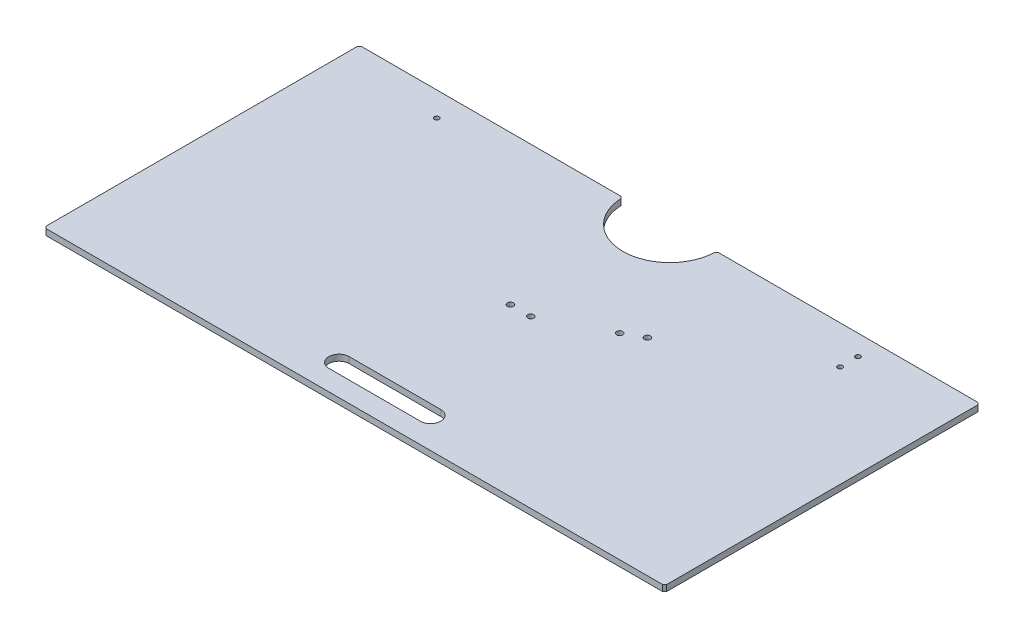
ISO-10303-21;
HEADER;
FILE_DESCRIPTION(('STEP AP214'),'2;1');
FILE_NAME('part.step','',(''),(''),'','','');
FILE_SCHEMA(('AUTOMOTIVE_DESIGN { 1 0 10303 214 1 1 1 1 }'));
ENDSEC;
DATA;
#1=APPLICATION_CONTEXT('core data for automotive mechanical design processes');
#2=APPLICATION_PROTOCOL_DEFINITION('international standard','automotive_design',2000,#1);
#3=PRODUCT_CONTEXT('',#1,'mechanical');
#4=PRODUCT('Part','Part','',(#3));
#5=PRODUCT_RELATED_PRODUCT_CATEGORY('part','',(#4));
#6=PRODUCT_DEFINITION_FORMATION('','',#4);
#7=PRODUCT_DEFINITION_CONTEXT('part definition',#1,'design');
#8=PRODUCT_DEFINITION('design','',#6,#7);
#9=PRODUCT_DEFINITION_SHAPE('','',#8);
#10=(LENGTH_UNIT() NAMED_UNIT(*) SI_UNIT(.MILLI.,.METRE.));
#11=(NAMED_UNIT(*) PLANE_ANGLE_UNIT() SI_UNIT($,.RADIAN.));
#12=(NAMED_UNIT(*) SI_UNIT($,.STERADIAN.) SOLID_ANGLE_UNIT());
#13=UNCERTAINTY_MEASURE_WITH_UNIT(LENGTH_MEASURE(1.E-05),#10,'distance_accuracy_value','');
#14=(GEOMETRIC_REPRESENTATION_CONTEXT(3) GLOBAL_UNCERTAINTY_ASSIGNED_CONTEXT((#13)) GLOBAL_UNIT_ASSIGNED_CONTEXT((#10,
#11,#12)) REPRESENTATION_CONTEXT('',''));
#15=CARTESIAN_POINT('',(0.,0.,0.));
#16=DIRECTION('',(0.,0.,1.));
#17=DIRECTION('',(1.,0.,0.));
#18=AXIS2_PLACEMENT_3D('',#15,#16,#17);
#19=CARTESIAN_POINT('',(305.,6.,-310.));
#20=DIRECTION('',(0.,1.,0.));
#21=DIRECTION('',(0.,0.,1.));
#22=AXIS2_PLACEMENT_3D('',#19,#20,#21);
#23=PLANE('',#22);
#24=CARTESIAN_POINT('',(373.006474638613,6.,-192.83));
#25=DIRECTION('',(0.,1.,0.));
#26=DIRECTION('',(0.,0.,-1.));
#27=AXIS2_PLACEMENT_3D('',#24,#25,#26);
#28=CIRCLE('',#27,3.00000000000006);
#29=CARTESIAN_POINT('',(373.006474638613,6.,-195.83));
#30=VERTEX_POINT('',#29);
#31=EDGE_CURVE('E581',#30,#30,#28,.T.);
#32=ORIENTED_EDGE('',*,*,#31,.F.);
#33=EDGE_LOOP('',(#32));
#34=FACE_BOUND('',#33,.T.);
#35=CARTESIAN_POINT('',(390.418378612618,6.,-202.67));
#36=DIRECTION('',(0.,1.,0.));
#37=DIRECTION('',(0.,0.,-1.));
#38=AXIS2_PLACEMENT_3D('',#35,#36,#37);
#39=CIRCLE('',#38,3.00000000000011);
#40=CARTESIAN_POINT('',(390.418378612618,6.,-205.67));
#41=VERTEX_POINT('',#40);
#42=EDGE_CURVE('E583',#41,#41,#39,.T.);
#43=ORIENTED_EDGE('',*,*,#42,.F.);
#44=EDGE_LOOP('',(#43));
#45=FACE_BOUND('',#44,.T.);
#46=CARTESIAN_POINT('',(315.,6.,-163.5));
#47=DIRECTION('',(0.,1.,0.));
#48=DIRECTION('',(0.,0.,1.));
#49=AXIS2_PLACEMENT_3D('',#46,#47,#48);
#50=CIRCLE('',#49,2.99999999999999);
#51=CARTESIAN_POINT('',(315.,6.,-160.5));
#52=VERTEX_POINT('',#51);
#53=EDGE_CURVE('E589',#52,#52,#50,.T.);
#54=ORIENTED_EDGE('',*,*,#53,.F.);
#55=EDGE_LOOP('',(#54));
#56=FACE_BOUND('',#55,.T.);
#57=CARTESIAN_POINT('',(295.,6.,-163.5));
#58=DIRECTION('',(0.,1.,0.));
#59=DIRECTION('',(0.,0.,1.));
#60=AXIS2_PLACEMENT_3D('',#57,#58,#59);
#61=CIRCLE('',#60,2.99999999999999);
#62=CARTESIAN_POINT('',(295.,6.,-160.5));
#63=VERTEX_POINT('',#62);
#64=EDGE_CURVE('E595',#63,#63,#61,.T.);
#65=ORIENTED_EDGE('',*,*,#64,.F.);
#66=EDGE_LOOP('',(#65));
#67=FACE_BOUND('',#66,.T.);
#68=CARTESIAN_POINT('',(510.,6.,-272.5));
#69=DIRECTION('',(0.,1.,0.));
#70=DIRECTION('',(0.,0.,1.));
#71=AXIS2_PLACEMENT_3D('',#68,#69,#70);
#72=CIRCLE('',#71,2.39999999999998);
#73=CARTESIAN_POINT('',(510.,6.,-270.1));
#74=VERTEX_POINT('',#73);
#75=EDGE_CURVE('E191',#74,#74,#72,.T.);
#76=ORIENTED_EDGE('',*,*,#75,.F.);
#77=EDGE_LOOP('',(#76));
#78=FACE_BOUND('',#77,.T.);
#79=CARTESIAN_POINT('',(100.,6.,-286.));
#80=DIRECTION('',(0.,1.,0.));
#81=DIRECTION('',(0.,0.,1.));
#82=AXIS2_PLACEMENT_3D('',#79,#80,#81);
#83=CIRCLE('',#82,2.4);
#84=CARTESIAN_POINT('',(100.,6.,-283.6));
#85=VERTEX_POINT('',#84);
#86=EDGE_CURVE('E203',#85,#85,#83,.T.);
#87=ORIENTED_EDGE('',*,*,#86,.F.);
#88=EDGE_LOOP('',(#87));
#89=FACE_BOUND('',#88,.T.);
#90=DIRECTION('',(1.,0.,0.));
#91=VECTOR('',#90,1.);
#92=CARTESIAN_POINT('',(0.,6.,0.));
#93=LINE('',#92,#91);
#94=CARTESIAN_POINT('',(1.99999999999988,6.,0.));
#95=VERTEX_POINT('',#94);
#96=CARTESIAN_POINT('',(608.,6.,0.));
#97=VERTEX_POINT('',#96);
#98=EDGE_CURVE('E212',#95,#97,#93,.T.);
#99=ORIENTED_EDGE('',*,*,#98,.T.);
#100=DIRECTION('',(-0.707106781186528,0.,0.707106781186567));
#101=VECTOR('',#100,1.);
#102=CARTESIAN_POINT('',(611.500000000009,6.,-3.50000000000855));
#103=LINE('',#102,#101);
#104=CARTESIAN_POINT('',(610.,6.,-1.99999999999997));
#105=VERTEX_POINT('',#104);
#106=EDGE_CURVE('E272',#97,#105,#103,.F.);
#107=ORIENTED_EDGE('',*,*,#106,.T.);
#108=DIRECTION('',(0.,0.,-1.));
#109=VECTOR('',#108,1.);
#110=CARTESIAN_POINT('',(610.,6.,0.));
#111=LINE('',#110,#109);
#112=CARTESIAN_POINT('',(610.,6.,-308.));
#113=VERTEX_POINT('',#112);
#114=EDGE_CURVE('E216',#105,#113,#111,.T.);
#115=ORIENTED_EDGE('',*,*,#114,.T.);
#116=DIRECTION('',(0.707106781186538,0.,0.707106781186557));
#117=VECTOR('',#116,1.);
#118=CARTESIAN_POINT('',(456.500000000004,6.,-461.5));
#119=LINE('',#118,#117);
#120=CARTESIAN_POINT('',(608.,6.,-310.));
#121=VERTEX_POINT('',#120);
#122=EDGE_CURVE('E266',#113,#121,#119,.F.);
#123=ORIENTED_EDGE('',*,*,#122,.T.);
#124=DIRECTION('',(-1.,0.,0.));
#125=VECTOR('',#124,1.);
#126=CARTESIAN_POINT('',(351.,6.,-310.));
#127=LINE('',#126,#125);
#128=CARTESIAN_POINT('',(353.,6.,-310.));
#129=VERTEX_POINT('',#128);
#130=EDGE_CURVE('E219',#121,#129,#127,.T.);
#131=ORIENTED_EDGE('',*,*,#130,.T.);
#132=DIRECTION('',(0.707106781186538,0.,-0.707106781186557));
#133=VECTOR('',#132,1.);
#134=CARTESIAN_POINT('',(329.000000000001,6.,-286.));
#135=LINE('',#134,#133);
#136=CARTESIAN_POINT('',(350.9544984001,6.,-307.9544984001));
#137=VERTEX_POINT('',#136);
#138=EDGE_CURVE('E264',#129,#137,#135,.F.);
#139=ORIENTED_EDGE('',*,*,#138,.T.);
#140=CARTESIAN_POINT('',(305.,6.,-310.));
#141=DIRECTION('',(0.,-1.,0.));
#142=DIRECTION('',(0.,0.,1.));
#143=AXIS2_PLACEMENT_3D('',#140,#141,#142);
#144=CIRCLE('',#143,46.);
#145=CARTESIAN_POINT('',(259.0455015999,6.,-307.9544984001));
#146=VERTEX_POINT('',#145);
#147=EDGE_CURVE('E222',#137,#146,#144,.T.);
#148=ORIENTED_EDGE('',*,*,#147,.T.);
#149=DIRECTION('',(0.707106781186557,0.,0.707106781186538));
#150=VECTOR('',#149,1.);
#151=CARTESIAN_POINT('',(281.000000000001,6.,-286.));
#152=LINE('',#151,#150);
#153=CARTESIAN_POINT('',(257.,6.,-310.));
#154=VERTEX_POINT('',#153);
#155=EDGE_CURVE('E54',#146,#154,#152,.F.);
#156=ORIENTED_EDGE('',*,*,#155,.T.);
#157=DIRECTION('',(-1.,0.,0.));
#158=VECTOR('',#157,1.);
#159=CARTESIAN_POINT('',(0.,6.,-310.));
#160=LINE('',#159,#158);
#161=CARTESIAN_POINT('',(2.,6.,-310.));
#162=VERTEX_POINT('',#161);
#163=EDGE_CURVE('E224',#154,#162,#160,.T.);
#164=ORIENTED_EDGE('',*,*,#163,.T.);
#165=DIRECTION('',(0.707106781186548,0.,-0.707106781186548));
#166=VECTOR('',#165,1.);
#167=CARTESIAN_POINT('',(153.5,6.,-461.5));
#168=LINE('',#167,#166);
#169=CARTESIAN_POINT('',(0.,6.,-308.));
#170=VERTEX_POINT('',#169);
#171=EDGE_CURVE('E268',#162,#170,#168,.F.);
#172=ORIENTED_EDGE('',*,*,#171,.T.);
#173=DIRECTION('',(0.,0.,1.));
#174=VECTOR('',#173,1.);
#175=CARTESIAN_POINT('',(0.,6.,0.));
#176=LINE('',#175,#174);
#177=CARTESIAN_POINT('',(0.,6.,-1.99999999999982));
#178=VERTEX_POINT('',#177);
#179=EDGE_CURVE('E209',#170,#178,#176,.T.);
#180=ORIENTED_EDGE('',*,*,#179,.T.);
#181=DIRECTION('',(-0.707106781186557,0.,-0.707106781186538));
#182=VECTOR('',#181,1.);
#183=CARTESIAN_POINT('',(-1.49999999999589,6.,-3.49999999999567));
#184=LINE('',#183,#182);
#185=EDGE_CURVE('E270',#178,#95,#184,.F.);
#186=ORIENTED_EDGE('',*,*,#185,.T.);
#187=EDGE_LOOP('',(#99,#107,#115,#123,#131,#139,#148,#156,#164,#172,#180,#186));
#188=FACE_BOUND('',#187,.T.);
#189=CARTESIAN_POINT('',(510.,6.,-290.));
#190=DIRECTION('',(0.,1.,0.));
#191=DIRECTION('',(0.,0.,1.));
#192=AXIS2_PLACEMENT_3D('',#189,#190,#191);
#193=CIRCLE('',#192,2.39999999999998);
#194=CARTESIAN_POINT('',(510.,6.,-287.6));
#195=VERTEX_POINT('',#194);
#196=EDGE_CURVE('E197',#195,#195,#193,.T.);
#197=ORIENTED_EDGE('',*,*,#196,.F.);
#198=EDGE_LOOP('',(#197));
#199=FACE_BOUND('',#198,.T.);
#200=DIRECTION('',(1.,0.,0.));
#201=VECTOR('',#200,1.);
#202=CARTESIAN_POINT('',(260.,6.,-20.));
#203=LINE('',#202,#201);
#204=CARTESIAN_POINT('',(260.,6.,-20.));
#205=VERTEX_POINT('',#204);
#206=CARTESIAN_POINT('',(350.,6.,-20.));
#207=VERTEX_POINT('',#206);
#208=EDGE_CURVE('E158',#205,#207,#203,.T.);
#209=ORIENTED_EDGE('',*,*,#208,.F.);
#210=CARTESIAN_POINT('',(260.,6.,-30.));
#211=DIRECTION('',(0.,1.,0.));
#212=DIRECTION('',(0.,0.,1.));
#213=AXIS2_PLACEMENT_3D('',#210,#211,#212);
#214=CIRCLE('',#213,10.);
#215=CARTESIAN_POINT('',(260.,6.,-40.));
#216=VERTEX_POINT('',#215);
#217=EDGE_CURVE('E148',#216,#205,#214,.T.);
#218=ORIENTED_EDGE('',*,*,#217,.F.);
#219=DIRECTION('',(-1.,0.,0.));
#220=VECTOR('',#219,1.);
#221=CARTESIAN_POINT('',(260.,6.,-40.));
#222=LINE('',#221,#220);
#223=CARTESIAN_POINT('',(350.,6.,-40.));
#224=VERTEX_POINT('',#223);
#225=EDGE_CURVE('E173',#224,#216,#222,.T.);
#226=ORIENTED_EDGE('',*,*,#225,.F.);
#227=CARTESIAN_POINT('',(350.,6.,-30.));
#228=DIRECTION('',(0.,1.,0.));
#229=DIRECTION('',(0.,0.,1.));
#230=AXIS2_PLACEMENT_3D('',#227,#228,#229);
#231=CIRCLE('',#230,10.);
#232=EDGE_CURVE('E171',#207,#224,#231,.T.);
#233=ORIENTED_EDGE('',*,*,#232,.F.);
#234=EDGE_LOOP('',(#209,#218,#226,#233));
#235=FACE_BOUND('',#234,.T.);
#236=ADVANCED_FACE('F32',(#34,#45,#56,#67,#78,#89,#188,#199,#235),#23,.T.);
#237=CARTESIAN_POINT('',(305.,0.,-310.));
#238=DIRECTION('',(0.,1.,0.));
#239=DIRECTION('',(0.,0.,1.));
#240=AXIS2_PLACEMENT_3D('',#237,#238,#239);
#241=PLANE('',#240);
#242=CARTESIAN_POINT('',(373.006474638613,0.,-192.83));
#243=DIRECTION('',(0.,1.,0.));
#244=DIRECTION('',(0.,0.,-1.));
#245=AXIS2_PLACEMENT_3D('',#242,#243,#244);
#246=CIRCLE('',#245,3.00000000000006);
#247=CARTESIAN_POINT('',(373.006474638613,0.,-195.83));
#248=VERTEX_POINT('',#247);
#249=EDGE_CURVE('E579',#248,#248,#246,.T.);
#250=ORIENTED_EDGE('',*,*,#249,.T.);
#251=EDGE_LOOP('',(#250));
#252=FACE_BOUND('',#251,.T.);
#253=CARTESIAN_POINT('',(390.418378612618,0.,-202.67));
#254=DIRECTION('',(0.,1.,0.));
#255=DIRECTION('',(0.,0.,-1.));
#256=AXIS2_PLACEMENT_3D('',#253,#254,#255);
#257=CIRCLE('',#256,3.00000000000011);
#258=CARTESIAN_POINT('',(390.418378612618,0.,-205.67));
#259=VERTEX_POINT('',#258);
#260=EDGE_CURVE('E586',#259,#259,#257,.T.);
#261=ORIENTED_EDGE('',*,*,#260,.T.);
#262=EDGE_LOOP('',(#261));
#263=FACE_BOUND('',#262,.T.);
#264=CARTESIAN_POINT('',(315.,0.,-163.5));
#265=DIRECTION('',(0.,1.,0.));
#266=DIRECTION('',(0.,0.,1.));
#267=AXIS2_PLACEMENT_3D('',#264,#265,#266);
#268=CIRCLE('',#267,2.99999999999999);
#269=CARTESIAN_POINT('',(315.,0.,-160.5));
#270=VERTEX_POINT('',#269);
#271=EDGE_CURVE('E592',#270,#270,#268,.T.);
#272=ORIENTED_EDGE('',*,*,#271,.T.);
#273=EDGE_LOOP('',(#272));
#274=FACE_BOUND('',#273,.T.);
#275=CARTESIAN_POINT('',(295.,0.,-163.5));
#276=DIRECTION('',(0.,1.,0.));
#277=DIRECTION('',(0.,0.,1.));
#278=AXIS2_PLACEMENT_3D('',#275,#276,#277);
#279=CIRCLE('',#278,2.99999999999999);
#280=CARTESIAN_POINT('',(295.,0.,-160.5));
#281=VERTEX_POINT('',#280);
#282=EDGE_CURVE('E180',#281,#281,#279,.T.);
#283=ORIENTED_EDGE('',*,*,#282,.T.);
#284=EDGE_LOOP('',(#283));
#285=FACE_BOUND('',#284,.T.);
#286=CARTESIAN_POINT('',(510.,0.,-272.5));
#287=DIRECTION('',(0.,1.,0.));
#288=DIRECTION('',(0.,0.,1.));
#289=AXIS2_PLACEMENT_3D('',#286,#287,#288);
#290=CIRCLE('',#289,2.39999999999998);
#291=CARTESIAN_POINT('',(510.,0.,-270.1));
#292=VERTEX_POINT('',#291);
#293=EDGE_CURVE('E166',#292,#292,#290,.T.);
#294=ORIENTED_EDGE('',*,*,#293,.T.);
#295=EDGE_LOOP('',(#294));
#296=FACE_BOUND('',#295,.T.);
#297=CARTESIAN_POINT('',(100.,0.,-286.));
#298=DIRECTION('',(0.,1.,0.));
#299=DIRECTION('',(0.,0.,1.));
#300=AXIS2_PLACEMENT_3D('',#297,#298,#299);
#301=CIRCLE('',#300,2.4);
#302=CARTESIAN_POINT('',(100.,0.,-283.6));
#303=VERTEX_POINT('',#302);
#304=EDGE_CURVE('E200',#303,#303,#301,.T.);
#305=ORIENTED_EDGE('',*,*,#304,.T.);
#306=EDGE_LOOP('',(#305));
#307=FACE_BOUND('',#306,.T.);
#308=DIRECTION('',(0.,0.,-1.));
#309=VECTOR('',#308,1.);
#310=CARTESIAN_POINT('',(610.,0.,0.));
#311=LINE('',#310,#309);
#312=CARTESIAN_POINT('',(610.,0.,-2.));
#313=VERTEX_POINT('',#312);
#314=CARTESIAN_POINT('',(610.,0.,-308.));
#315=VERTEX_POINT('',#314);
#316=EDGE_CURVE('E232',#313,#315,#311,.T.);
#317=ORIENTED_EDGE('',*,*,#316,.F.);
#318=DIRECTION('',(0.707106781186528,0.,-0.707106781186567));
#319=VECTOR('',#318,1.);
#320=CARTESIAN_POINT('',(610.,0.,-2.));
#321=LINE('',#320,#319);
#322=CARTESIAN_POINT('',(608.,0.,0.));
#323=VERTEX_POINT('',#322);
#324=EDGE_CURVE('E256',#313,#323,#321,.F.);
#325=ORIENTED_EDGE('',*,*,#324,.T.);
#326=DIRECTION('',(1.,0.,0.));
#327=VECTOR('',#326,1.);
#328=CARTESIAN_POINT('',(0.,0.,0.));
#329=LINE('',#328,#327);
#330=CARTESIAN_POINT('',(2.,0.,0.));
#331=VERTEX_POINT('',#330);
#332=EDGE_CURVE('E229',#331,#323,#329,.T.);
#333=ORIENTED_EDGE('',*,*,#332,.F.);
#334=DIRECTION('',(0.707106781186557,0.,0.707106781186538));
#335=VECTOR('',#334,1.);
#336=CARTESIAN_POINT('',(2.,0.,0.));
#337=LINE('',#336,#335);
#338=CARTESIAN_POINT('',(0.,0.,-1.99999999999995));
#339=VERTEX_POINT('',#338);
#340=EDGE_CURVE('E254',#331,#339,#337,.F.);
#341=ORIENTED_EDGE('',*,*,#340,.T.);
#342=DIRECTION('',(0.,0.,1.));
#343=VECTOR('',#342,1.);
#344=CARTESIAN_POINT('',(0.,0.,0.));
#345=LINE('',#344,#343);
#346=CARTESIAN_POINT('',(0.,0.,-308.));
#347=VERTEX_POINT('',#346);
#348=EDGE_CURVE('E206',#347,#339,#345,.T.);
#349=ORIENTED_EDGE('',*,*,#348,.F.);
#350=DIRECTION('',(-0.707106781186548,0.,0.707106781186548));
#351=VECTOR('',#350,1.);
#352=CARTESIAN_POINT('',(0.,0.,-308.));
#353=LINE('',#352,#351);
#354=CARTESIAN_POINT('',(2.,0.,-310.));
#355=VERTEX_POINT('',#354);
#356=EDGE_CURVE('E252',#347,#355,#353,.F.);
#357=ORIENTED_EDGE('',*,*,#356,.T.);
#358=DIRECTION('',(-1.,0.,0.));
#359=VECTOR('',#358,1.);
#360=CARTESIAN_POINT('',(0.,0.,-310.));
#361=LINE('',#360,#359);
#362=CARTESIAN_POINT('',(257.,0.,-310.));
#363=VERTEX_POINT('',#362);
#364=EDGE_CURVE('E213',#363,#355,#361,.T.);
#365=ORIENTED_EDGE('',*,*,#364,.F.);
#366=DIRECTION('',(-0.707106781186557,0.,-0.707106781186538));
#367=VECTOR('',#366,1.);
#368=CARTESIAN_POINT('',(257.,0.,-310.));
#369=LINE('',#368,#367);
#370=CARTESIAN_POINT('',(259.0455015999,0.,-307.9544984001));
#371=VERTEX_POINT('',#370);
#372=EDGE_CURVE('E246',#363,#371,#369,.F.);
#373=ORIENTED_EDGE('',*,*,#372,.T.);
#374=CARTESIAN_POINT('',(305.,0.,-310.));
#375=DIRECTION('',(0.,-1.,0.));
#376=DIRECTION('',(0.,0.,1.));
#377=AXIS2_PLACEMENT_3D('',#374,#375,#376);
#378=CIRCLE('',#377,46.);
#379=CARTESIAN_POINT('',(350.9544984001,0.,-307.9544984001));
#380=VERTEX_POINT('',#379);
#381=EDGE_CURVE('E238',#380,#371,#378,.T.);
#382=ORIENTED_EDGE('',*,*,#381,.F.);
#383=DIRECTION('',(-0.707106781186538,0.,0.707106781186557));
#384=VECTOR('',#383,1.);
#385=CARTESIAN_POINT('',(350.9544984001,0.,-307.9544984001));
#386=LINE('',#385,#384);
#387=CARTESIAN_POINT('',(353.,0.,-310.));
#388=VERTEX_POINT('',#387);
#389=EDGE_CURVE('E248',#380,#388,#386,.F.);
#390=ORIENTED_EDGE('',*,*,#389,.T.);
#391=DIRECTION('',(-1.,0.,0.));
#392=VECTOR('',#391,1.);
#393=CARTESIAN_POINT('',(351.,0.,-310.));
#394=LINE('',#393,#392);
#395=CARTESIAN_POINT('',(608.,0.,-310.));
#396=VERTEX_POINT('',#395);
#397=EDGE_CURVE('E235',#396,#388,#394,.T.);
#398=ORIENTED_EDGE('',*,*,#397,.F.);
#399=DIRECTION('',(-0.707106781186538,0.,-0.707106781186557));
#400=VECTOR('',#399,1.);
#401=CARTESIAN_POINT('',(608.,0.,-310.));
#402=LINE('',#401,#400);
#403=EDGE_CURVE('E250',#396,#315,#402,.F.);
#404=ORIENTED_EDGE('',*,*,#403,.T.);
#405=EDGE_LOOP('',(#317,#325,#333,#341,#349,#357,#365,#373,#382,#390,#398,#404));
#406=FACE_BOUND('',#405,.T.);
#407=CARTESIAN_POINT('',(510.,0.,-290.));
#408=DIRECTION('',(0.,1.,0.));
#409=DIRECTION('',(0.,0.,1.));
#410=AXIS2_PLACEMENT_3D('',#407,#408,#409);
#411=CIRCLE('',#410,2.39999999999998);
#412=CARTESIAN_POINT('',(510.,0.,-287.6));
#413=VERTEX_POINT('',#412);
#414=EDGE_CURVE('E194',#413,#413,#411,.T.);
#415=ORIENTED_EDGE('',*,*,#414,.T.);
#416=EDGE_LOOP('',(#415));
#417=FACE_BOUND('',#416,.T.);
#418=CARTESIAN_POINT('',(260.,0.,-30.));
#419=DIRECTION('',(0.,1.,0.));
#420=DIRECTION('',(0.,0.,1.));
#421=AXIS2_PLACEMENT_3D('',#418,#419,#420);
#422=CIRCLE('',#421,10.);
#423=CARTESIAN_POINT('',(260.,0.,-40.));
#424=VERTEX_POINT('',#423);
#425=CARTESIAN_POINT('',(260.,0.,-20.));
#426=VERTEX_POINT('',#425);
#427=EDGE_CURVE('E178',#424,#426,#422,.T.);
#428=ORIENTED_EDGE('',*,*,#427,.T.);
#429=DIRECTION('',(1.,0.,0.));
#430=VECTOR('',#429,1.);
#431=CARTESIAN_POINT('',(260.,0.,-20.));
#432=LINE('',#431,#430);
#433=CARTESIAN_POINT('',(350.,0.,-20.));
#434=VERTEX_POINT('',#433);
#435=EDGE_CURVE('E165',#426,#434,#432,.T.);
#436=ORIENTED_EDGE('',*,*,#435,.T.);
#437=CARTESIAN_POINT('',(350.,0.,-30.));
#438=DIRECTION('',(0.,1.,0.));
#439=DIRECTION('',(0.,0.,1.));
#440=AXIS2_PLACEMENT_3D('',#437,#438,#439);
#441=CIRCLE('',#440,10.);
#442=CARTESIAN_POINT('',(350.,0.,-40.));
#443=VERTEX_POINT('',#442);
#444=EDGE_CURVE('E182',#434,#443,#441,.T.);
#445=ORIENTED_EDGE('',*,*,#444,.T.);
#446=DIRECTION('',(-1.,0.,0.));
#447=VECTOR('',#446,1.);
#448=CARTESIAN_POINT('',(260.,0.,-40.));
#449=LINE('',#448,#447);
#450=EDGE_CURVE('E159',#443,#424,#449,.T.);
#451=ORIENTED_EDGE('',*,*,#450,.T.);
#452=EDGE_LOOP('',(#428,#436,#445,#451));
#453=FACE_BOUND('',#452,.T.);
#454=ADVANCED_FACE('F301',(#252,#263,#274,#285,#296,#307,#406,#417,#453),#241,.F.);
#455=CARTESIAN_POINT('',(0.,6.,0.));
#456=DIRECTION('',(1.,0.,0.));
#457=DIRECTION('',(0.,0.,-1.));
#458=AXIS2_PLACEMENT_3D('',#455,#456,#457);
#459=PLANE('',#458);
#460=ORIENTED_EDGE('',*,*,#348,.T.);
#461=DIRECTION('',(0.,1.,0.));
#462=VECTOR('',#461,1.);
#463=CARTESIAN_POINT('',(0.,6.,-1.99999999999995));
#464=LINE('',#463,#462);
#465=EDGE_CURVE('E277',#339,#178,#464,.T.);
#466=ORIENTED_EDGE('',*,*,#465,.T.);
#467=ORIENTED_EDGE('',*,*,#179,.F.);
#468=DIRECTION('',(0.,-1.,0.));
#469=VECTOR('',#468,1.);
#470=CARTESIAN_POINT('',(0.,6.,-308.));
#471=LINE('',#470,#469);
#472=EDGE_CURVE('E274',#170,#347,#471,.T.);
#473=ORIENTED_EDGE('',*,*,#472,.T.);
#474=EDGE_LOOP('',(#460,#466,#467,#473));
#475=FACE_BOUND('',#474,.T.);
#476=ADVANCED_FACE('F310',(#475),#459,.F.);
#477=CARTESIAN_POINT('',(0.,6.,0.));
#478=DIRECTION('',(0.,0.,-1.));
#479=DIRECTION('',(-1.,0.,0.));
#480=AXIS2_PLACEMENT_3D('',#477,#478,#479);
#481=PLANE('',#480);
#482=ORIENTED_EDGE('',*,*,#332,.T.);
#483=DIRECTION('',(0.,1.,0.));
#484=VECTOR('',#483,1.);
#485=CARTESIAN_POINT('',(608.,6.,0.));
#486=LINE('',#485,#484);
#487=EDGE_CURVE('E261',#323,#97,#486,.T.);
#488=ORIENTED_EDGE('',*,*,#487,.T.);
#489=ORIENTED_EDGE('',*,*,#98,.F.);
#490=DIRECTION('',(0.,-1.,0.));
#491=VECTOR('',#490,1.);
#492=CARTESIAN_POINT('',(2.,6.,0.));
#493=LINE('',#492,#491);
#494=EDGE_CURVE('E258',#95,#331,#493,.T.);
#495=ORIENTED_EDGE('',*,*,#494,.T.);
#496=EDGE_LOOP('',(#482,#488,#489,#495));
#497=FACE_BOUND('',#496,.T.);
#498=ADVANCED_FACE('F319',(#497),#481,.F.);
#499=CARTESIAN_POINT('',(610.,6.,0.));
#500=DIRECTION('',(-1.,0.,0.));
#501=DIRECTION('',(0.,0.,1.));
#502=AXIS2_PLACEMENT_3D('',#499,#500,#501);
#503=PLANE('',#502);
#504=ORIENTED_EDGE('',*,*,#114,.F.);
#505=DIRECTION('',(0.,-1.,0.));
#506=VECTOR('',#505,1.);
#507=CARTESIAN_POINT('',(610.,6.,-2.));
#508=LINE('',#507,#506);
#509=EDGE_CURVE('E243',#105,#313,#508,.T.);
#510=ORIENTED_EDGE('',*,*,#509,.T.);
#511=ORIENTED_EDGE('',*,*,#316,.T.);
#512=DIRECTION('',(0.,1.,0.));
#513=VECTOR('',#512,1.);
#514=CARTESIAN_POINT('',(610.,6.,-308.));
#515=LINE('',#514,#513);
#516=EDGE_CURVE('E226',#315,#113,#515,.T.);
#517=ORIENTED_EDGE('',*,*,#516,.T.);
#518=EDGE_LOOP('',(#504,#510,#511,#517));
#519=FACE_BOUND('',#518,.T.);
#520=ADVANCED_FACE('F327',(#519),#503,.F.);
#521=CARTESIAN_POINT('',(351.,6.,-310.));
#522=DIRECTION('',(0.,0.,1.));
#523=DIRECTION('',(1.,0.,0.));
#524=AXIS2_PLACEMENT_3D('',#521,#522,#523);
#525=PLANE('',#524);
#526=ORIENTED_EDGE('',*,*,#130,.F.);
#527=DIRECTION('',(0.,-1.,0.));
#528=VECTOR('',#527,1.);
#529=CARTESIAN_POINT('',(608.,6.,-310.));
#530=LINE('',#529,#528);
#531=EDGE_CURVE('E285',#121,#396,#530,.T.);
#532=ORIENTED_EDGE('',*,*,#531,.T.);
#533=ORIENTED_EDGE('',*,*,#397,.T.);
#534=DIRECTION('',(0.,1.,0.));
#535=VECTOR('',#534,1.);
#536=CARTESIAN_POINT('',(353.,6.,-310.));
#537=LINE('',#536,#535);
#538=EDGE_CURVE('E283',#388,#129,#537,.T.);
#539=ORIENTED_EDGE('',*,*,#538,.T.);
#540=EDGE_LOOP('',(#526,#532,#533,#539));
#541=FACE_BOUND('',#540,.T.);
#542=ADVANCED_FACE('F336',(#541),#525,.F.);
#543=CARTESIAN_POINT('',(305.,6.,-310.));
#544=DIRECTION('',(0.,-1.,0.));
#545=DIRECTION('',(0.,0.,-1.));
#546=AXIS2_PLACEMENT_3D('',#543,#544,#545);
#547=CYLINDRICAL_SURFACE('',#546,46.);
#548=ORIENTED_EDGE('',*,*,#147,.F.);
#549=DIRECTION('',(0.,-1.,0.));
#550=VECTOR('',#549,1.);
#551=CARTESIAN_POINT('',(350.9544984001,6.,-307.9544984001));
#552=LINE('',#551,#550);
#553=EDGE_CURVE('E11',#137,#380,#552,.T.);
#554=ORIENTED_EDGE('',*,*,#553,.T.);
#555=ORIENTED_EDGE('',*,*,#381,.T.);
#556=DIRECTION('',(0.,-1.,0.));
#557=VECTOR('',#556,1.);
#558=CARTESIAN_POINT('',(259.0455015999,6.,-307.9544984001));
#559=LINE('',#558,#557);
#560=EDGE_CURVE('E40',#371,#146,#559,.F.);
#561=ORIENTED_EDGE('',*,*,#560,.T.);
#562=EDGE_LOOP('',(#548,#554,#555,#561));
#563=FACE_BOUND('',#562,.T.);
#564=ADVANCED_FACE('F290',(#563),#547,.F.);
#565=CARTESIAN_POINT('',(0.,6.,-310.));
#566=DIRECTION('',(0.,0.,1.));
#567=DIRECTION('',(1.,0.,0.));
#568=AXIS2_PLACEMENT_3D('',#565,#566,#567);
#569=PLANE('',#568);
#570=ORIENTED_EDGE('',*,*,#364,.T.);
#571=DIRECTION('',(0.,1.,0.));
#572=VECTOR('',#571,1.);
#573=CARTESIAN_POINT('',(2.,6.,-310.));
#574=LINE('',#573,#572);
#575=EDGE_CURVE('E47',#355,#162,#574,.T.);
#576=ORIENTED_EDGE('',*,*,#575,.T.);
#577=ORIENTED_EDGE('',*,*,#163,.F.);
#578=DIRECTION('',(0.,-1.,0.));
#579=VECTOR('',#578,1.);
#580=CARTESIAN_POINT('',(257.,6.,-310.));
#581=LINE('',#580,#579);
#582=EDGE_CURVE('E279',#154,#363,#581,.T.);
#583=ORIENTED_EDGE('',*,*,#582,.T.);
#584=EDGE_LOOP('',(#570,#576,#577,#583));
#585=FACE_BOUND('',#584,.T.);
#586=ADVANCED_FACE('F298',(#585),#569,.F.);
#587=CARTESIAN_POINT('',(100.,6.,-286.));
#588=DIRECTION('',(0.,-1.,0.));
#589=DIRECTION('',(0.,0.,-1.));
#590=AXIS2_PLACEMENT_3D('',#587,#588,#589);
#591=CYLINDRICAL_SURFACE('',#590,2.4);
#592=ORIENTED_EDGE('',*,*,#86,.T.);
#593=EDGE_LOOP('',(#592));
#594=FACE_BOUND('',#593,.T.);
#595=ORIENTED_EDGE('',*,*,#304,.F.);
#596=EDGE_LOOP('',(#595));
#597=FACE_BOUND('',#596,.T.);
#598=ADVANCED_FACE('F358',(#594,#597),#591,.F.);
#599=CARTESIAN_POINT('',(510.,6.,-290.));
#600=DIRECTION('',(0.,-1.,0.));
#601=DIRECTION('',(0.,0.,-1.));
#602=AXIS2_PLACEMENT_3D('',#599,#600,#601);
#603=CYLINDRICAL_SURFACE('',#602,2.39999999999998);
#604=ORIENTED_EDGE('',*,*,#196,.T.);
#605=EDGE_LOOP('',(#604));
#606=FACE_BOUND('',#605,.T.);
#607=ORIENTED_EDGE('',*,*,#414,.F.);
#608=EDGE_LOOP('',(#607));
#609=FACE_BOUND('',#608,.T.);
#610=ADVANCED_FACE('F467',(#606,#609),#603,.F.);
#611=CARTESIAN_POINT('',(510.,6.,-272.5));
#612=DIRECTION('',(0.,-1.,0.));
#613=DIRECTION('',(0.,0.,-1.));
#614=AXIS2_PLACEMENT_3D('',#611,#612,#613);
#615=CYLINDRICAL_SURFACE('',#614,2.39999999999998);
#616=ORIENTED_EDGE('',*,*,#75,.T.);
#617=EDGE_LOOP('',(#616));
#618=FACE_BOUND('',#617,.T.);
#619=ORIENTED_EDGE('',*,*,#293,.F.);
#620=EDGE_LOOP('',(#619));
#621=FACE_BOUND('',#620,.T.);
#622=ADVANCED_FACE('F465',(#618,#621),#615,.F.);
#623=CARTESIAN_POINT('',(260.,6.,-30.));
#624=DIRECTION('',(0.,-1.,0.));
#625=DIRECTION('',(0.,0.,-1.));
#626=AXIS2_PLACEMENT_3D('',#623,#624,#625);
#627=CYLINDRICAL_SURFACE('',#626,10.);
#628=ORIENTED_EDGE('',*,*,#427,.F.);
#629=DIRECTION('',(0.,-1.,0.));
#630=VECTOR('',#629,1.);
#631=CARTESIAN_POINT('',(260.,6.,-40.));
#632=LINE('',#631,#630);
#633=EDGE_CURVE('E154',#216,#424,#632,.T.);
#634=ORIENTED_EDGE('',*,*,#633,.F.);
#635=ORIENTED_EDGE('',*,*,#217,.T.);
#636=DIRECTION('',(0.,-1.,0.));
#637=VECTOR('',#636,1.);
#638=CARTESIAN_POINT('',(260.,6.,-20.));
#639=LINE('',#638,#637);
#640=EDGE_CURVE('E151',#205,#426,#639,.T.);
#641=ORIENTED_EDGE('',*,*,#640,.T.);
#642=EDGE_LOOP('',(#628,#634,#635,#641));
#643=FACE_BOUND('',#642,.T.);
#644=ADVANCED_FACE('F150',(#643),#627,.F.);
#645=CARTESIAN_POINT('',(260.,6.,-20.));
#646=DIRECTION('',(0.,0.,-1.));
#647=DIRECTION('',(-1.,0.,0.));
#648=AXIS2_PLACEMENT_3D('',#645,#646,#647);
#649=PLANE('',#648);
#650=ORIENTED_EDGE('',*,*,#435,.F.);
#651=ORIENTED_EDGE('',*,*,#640,.F.);
#652=ORIENTED_EDGE('',*,*,#208,.T.);
#653=DIRECTION('',(0.,-1.,0.));
#654=VECTOR('',#653,1.);
#655=CARTESIAN_POINT('',(350.,6.,-20.));
#656=LINE('',#655,#654);
#657=EDGE_CURVE('E167',#207,#434,#656,.T.);
#658=ORIENTED_EDGE('',*,*,#657,.T.);
#659=EDGE_LOOP('',(#650,#651,#652,#658));
#660=FACE_BOUND('',#659,.T.);
#661=ADVANCED_FACE('F162',(#660),#649,.T.);
#662=CARTESIAN_POINT('',(350.,6.,-30.));
#663=DIRECTION('',(0.,-1.,0.));
#664=DIRECTION('',(0.,0.,-1.));
#665=AXIS2_PLACEMENT_3D('',#662,#663,#664);
#666=CYLINDRICAL_SURFACE('',#665,10.);
#667=ORIENTED_EDGE('',*,*,#444,.F.);
#668=ORIENTED_EDGE('',*,*,#657,.F.);
#669=ORIENTED_EDGE('',*,*,#232,.T.);
#670=DIRECTION('',(0.,-1.,0.));
#671=VECTOR('',#670,1.);
#672=CARTESIAN_POINT('',(350.,6.,-40.));
#673=LINE('',#672,#671);
#674=EDGE_CURVE('E188',#224,#443,#673,.T.);
#675=ORIENTED_EDGE('',*,*,#674,.T.);
#676=EDGE_LOOP('',(#667,#668,#669,#675));
#677=FACE_BOUND('',#676,.T.);
#678=ADVANCED_FACE('F456',(#677),#666,.F.);
#679=CARTESIAN_POINT('',(260.,6.,-40.));
#680=DIRECTION('',(0.,0.,1.));
#681=DIRECTION('',(1.,0.,0.));
#682=AXIS2_PLACEMENT_3D('',#679,#680,#681);
#683=PLANE('',#682);
#684=ORIENTED_EDGE('',*,*,#450,.F.);
#685=ORIENTED_EDGE('',*,*,#674,.F.);
#686=ORIENTED_EDGE('',*,*,#225,.T.);
#687=ORIENTED_EDGE('',*,*,#633,.T.);
#688=EDGE_LOOP('',(#684,#685,#686,#687));
#689=FACE_BOUND('',#688,.T.);
#690=ADVANCED_FACE('F375',(#689),#683,.T.);
#691=CARTESIAN_POINT('',(610.,6.,-2.));
#692=DIRECTION('',(-0.707106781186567,0.,-0.707106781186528));
#693=DIRECTION('',(-0.707106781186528,0.,0.707106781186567));
#694=AXIS2_PLACEMENT_3D('',#691,#692,#693);
#695=PLANE('',#694);
#696=ORIENTED_EDGE('',*,*,#106,.F.);
#697=ORIENTED_EDGE('',*,*,#487,.F.);
#698=ORIENTED_EDGE('',*,*,#324,.F.);
#699=ORIENTED_EDGE('',*,*,#509,.F.);
#700=EDGE_LOOP('',(#696,#697,#698,#699));
#701=FACE_BOUND('',#700,.T.);
#702=ADVANCED_FACE('F324',(#701),#695,.F.);
#703=CARTESIAN_POINT('',(2.,6.,0.));
#704=DIRECTION('',(0.707106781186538,0.,-0.707106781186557));
#705=DIRECTION('',(-0.707106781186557,0.,-0.707106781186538));
#706=AXIS2_PLACEMENT_3D('',#703,#704,#705);
#707=PLANE('',#706);
#708=ORIENTED_EDGE('',*,*,#185,.F.);
#709=ORIENTED_EDGE('',*,*,#465,.F.);
#710=ORIENTED_EDGE('',*,*,#340,.F.);
#711=ORIENTED_EDGE('',*,*,#494,.F.);
#712=EDGE_LOOP('',(#708,#709,#710,#711));
#713=FACE_BOUND('',#712,.T.);
#714=ADVANCED_FACE('F316',(#713),#707,.F.);
#715=CARTESIAN_POINT('',(0.,6.,-308.));
#716=DIRECTION('',(0.707106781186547,0.,0.707106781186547));
#717=DIRECTION('',(0.707106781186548,0.,-0.707106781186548));
#718=AXIS2_PLACEMENT_3D('',#715,#716,#717);
#719=PLANE('',#718);
#720=ORIENTED_EDGE('',*,*,#171,.F.);
#721=ORIENTED_EDGE('',*,*,#575,.F.);
#722=ORIENTED_EDGE('',*,*,#356,.F.);
#723=ORIENTED_EDGE('',*,*,#472,.F.);
#724=EDGE_LOOP('',(#720,#721,#722,#723));
#725=FACE_BOUND('',#724,.T.);
#726=ADVANCED_FACE('F307',(#725),#719,.F.);
#727=CARTESIAN_POINT('',(608.,6.,-310.));
#728=DIRECTION('',(-0.707106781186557,0.,0.707106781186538));
#729=DIRECTION('',(0.707106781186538,0.,0.707106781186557));
#730=AXIS2_PLACEMENT_3D('',#727,#728,#729);
#731=PLANE('',#730);
#732=ORIENTED_EDGE('',*,*,#122,.F.);
#733=ORIENTED_EDGE('',*,*,#516,.F.);
#734=ORIENTED_EDGE('',*,*,#403,.F.);
#735=ORIENTED_EDGE('',*,*,#531,.F.);
#736=EDGE_LOOP('',(#732,#733,#734,#735));
#737=FACE_BOUND('',#736,.T.);
#738=ADVANCED_FACE('F333',(#737),#731,.F.);
#739=CARTESIAN_POINT('',(350.9544984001,6.,-307.9544984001));
#740=DIRECTION('',(0.707106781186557,0.,0.707106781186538));
#741=DIRECTION('',(0.707106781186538,0.,-0.707106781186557));
#742=AXIS2_PLACEMENT_3D('',#739,#740,#741);
#743=PLANE('',#742);
#744=ORIENTED_EDGE('',*,*,#138,.F.);
#745=ORIENTED_EDGE('',*,*,#538,.F.);
#746=ORIENTED_EDGE('',*,*,#389,.F.);
#747=ORIENTED_EDGE('',*,*,#553,.F.);
#748=EDGE_LOOP('',(#744,#745,#746,#747));
#749=FACE_BOUND('',#748,.T.);
#750=ADVANCED_FACE('F339',(#749),#743,.F.);
#751=CARTESIAN_POINT('',(257.,6.,-310.));
#752=DIRECTION('',(-0.707106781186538,0.,0.707106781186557));
#753=DIRECTION('',(0.707106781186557,0.,0.707106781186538));
#754=AXIS2_PLACEMENT_3D('',#751,#752,#753);
#755=PLANE('',#754);
#756=ORIENTED_EDGE('',*,*,#155,.F.);
#757=ORIENTED_EDGE('',*,*,#560,.F.);
#758=ORIENTED_EDGE('',*,*,#372,.F.);
#759=ORIENTED_EDGE('',*,*,#582,.F.);
#760=EDGE_LOOP('',(#756,#757,#758,#759));
#761=FACE_BOUND('',#760,.T.);
#762=ADVANCED_FACE('F34',(#761),#755,.F.);
#763=CARTESIAN_POINT('',(295.,0.,-163.5));
#764=DIRECTION('',(0.,1.,0.));
#765=DIRECTION('',(0.,0.,1.));
#766=AXIS2_PLACEMENT_3D('',#763,#764,#765);
#767=CYLINDRICAL_SURFACE('',#766,2.99999999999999);
#768=ORIENTED_EDGE('',*,*,#282,.F.);
#769=EDGE_LOOP('',(#768));
#770=FACE_BOUND('',#769,.T.);
#771=ORIENTED_EDGE('',*,*,#64,.T.);
#772=EDGE_LOOP('',(#771));
#773=FACE_BOUND('',#772,.T.);
#774=ADVANCED_FACE('F345',(#770,#773),#767,.F.);
#775=CARTESIAN_POINT('',(315.,0.,-163.5));
#776=DIRECTION('',(0.,1.,0.));
#777=DIRECTION('',(0.,0.,1.));
#778=AXIS2_PLACEMENT_3D('',#775,#776,#777);
#779=CYLINDRICAL_SURFACE('',#778,2.99999999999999);
#780=ORIENTED_EDGE('',*,*,#271,.F.);
#781=EDGE_LOOP('',(#780));
#782=FACE_BOUND('',#781,.T.);
#783=ORIENTED_EDGE('',*,*,#53,.T.);
#784=EDGE_LOOP('',(#783));
#785=FACE_BOUND('',#784,.T.);
#786=ADVANCED_FACE('F417',(#782,#785),#779,.F.);
#787=CARTESIAN_POINT('',(390.418378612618,0.,-202.67));
#788=DIRECTION('',(0.,1.,0.));
#789=DIRECTION('',(0.,0.,1.));
#790=AXIS2_PLACEMENT_3D('',#787,#788,#789);
#791=CYLINDRICAL_SURFACE('',#790,3.00000000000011);
#792=ORIENTED_EDGE('',*,*,#260,.F.);
#793=EDGE_LOOP('',(#792));
#794=FACE_BOUND('',#793,.T.);
#795=ORIENTED_EDGE('',*,*,#42,.T.);
#796=EDGE_LOOP('',(#795));
#797=FACE_BOUND('',#796,.T.);
#798=ADVANCED_FACE('F427',(#794,#797),#791,.F.);
#799=CARTESIAN_POINT('',(373.006474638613,0.,-192.83));
#800=DIRECTION('',(0.,1.,0.));
#801=DIRECTION('',(0.,0.,1.));
#802=AXIS2_PLACEMENT_3D('',#799,#800,#801);
#803=CYLINDRICAL_SURFACE('',#802,3.00000000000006);
#804=ORIENTED_EDGE('',*,*,#249,.F.);
#805=EDGE_LOOP('',(#804));
#806=FACE_BOUND('',#805,.T.);
#807=ORIENTED_EDGE('',*,*,#31,.T.);
#808=EDGE_LOOP('',(#807));
#809=FACE_BOUND('',#808,.T.);
#810=ADVANCED_FACE('F437',(#806,#809),#803,.F.);
#811=CLOSED_SHELL('',(#236,#454,#476,#498,#520,#542,#564,#586,#598,#610,#622,#644,#661,#678,
#690,#702,#714,#726,#738,#750,#762,#774,#786,#798,#810));
#812=MANIFOLD_SOLID_BREP('B2',#811);
#813=ADVANCED_BREP_SHAPE_REPRESENTATION('',(#18,#812),#14);
#814=SHAPE_DEFINITION_REPRESENTATION(#9,#813);
ENDSEC;
END-ISO-10303-21;
